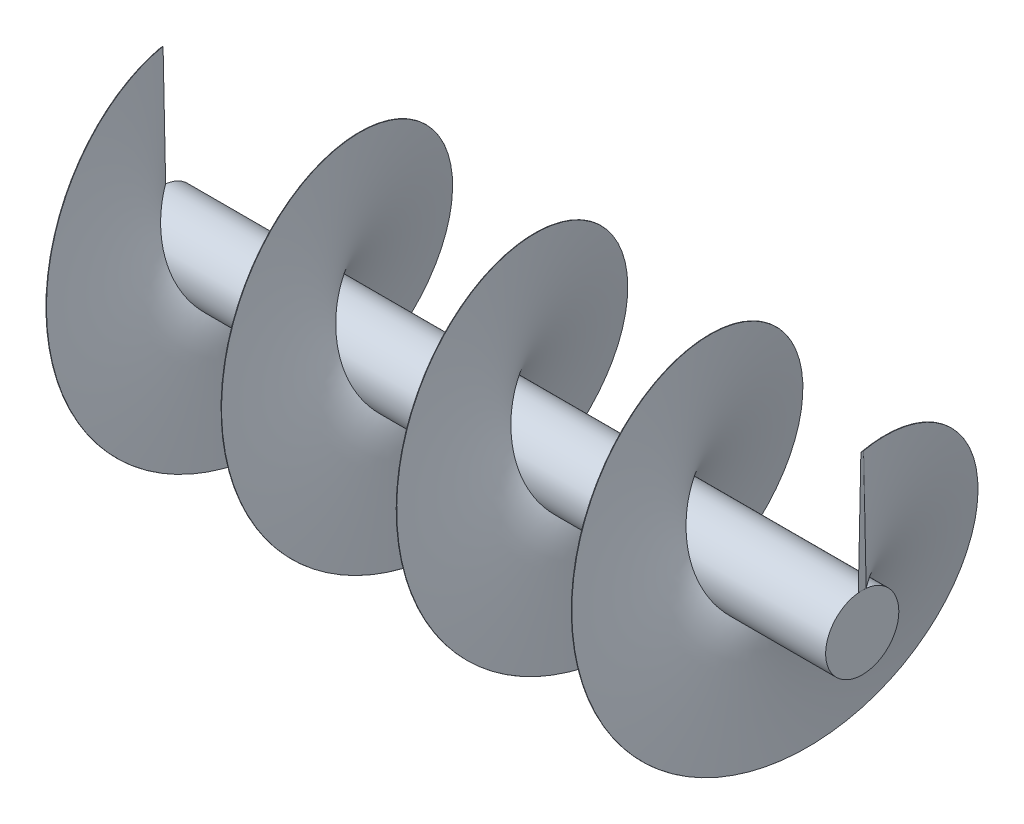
from build123d import *

# Parameters (mm, degrees)
SKETCH1_R           = 10
BOSS_EXTRUDE1_DEPTH = 390
BOSS_EXTRUDE2_START = 300
SKETCH1_3_R         = 10
BOSS_EXTRUDE2_DEPTH = 300
BOSS_EXTRUDE3_START = 300
SKETCH1_4_R         = 35
SKETCH1_4_R_2       = 25
BOSS_EXTRUDE3_DEPTH = 670
BOSS_EXTRUDE4_START = -360
SKETCH1_5_R         = 25
SKETCH1_5_R_2       = 10
BOSS_EXTRUDE4_DEPTH = 10
BOSS_EXTRUDE5_START = 300
SKETCH1_6_R         = 25
SKETCH1_6_R_2       = 10
BOSS_EXTRUDE5_DEPTH = 10
SWEEP1_PITCH        = 167.5
SWEEP1_HEIGHT       = 670
SWEEP1_RADIUS       = 150
SWEEP1_START_ANGLE  = -90


with BuildPart() as part:
    # Sketch1 → Boss-Extrude1 (new body)
    with BuildSketch(Plane(origin=(0, 0, 0), x_dir=(0, 0, -1), z_dir=(1, 0, 0))):
        Circle(SKETCH1_R)
    extrude(amount=-BOSS_EXTRUDE1_DEPTH)

    # Sketch1_3 → Boss-Extrude2 (add)
    with BuildSketch(Plane(origin=(0, 0, 0), x_dir=(0, 0, -1), z_dir=(1, 0, 0)).offset(BOSS_EXTRUDE2_START)):
        Circle(SKETCH1_3_R)
    extrude(amount=-BOSS_EXTRUDE2_DEPTH)



with BuildPart() as body_2:
    # Sketch1_4 → Boss-Extrude3 (new body)
    with BuildSketch(Plane(origin=(0, 0, 0), x_dir=(0, 0, -1), z_dir=(1, 0, 0)).offset(BOSS_EXTRUDE3_START)):
        Circle(SKETCH1_4_R)
        Circle(SKETCH1_4_R_2, mode=Mode.SUBTRACT)
    extrude(amount=-BOSS_EXTRUDE3_DEPTH)


with BuildPart() as part_1:
    add(part.part)

    add(body_2.part)  # Boss-Extrude4 merges body 2
    # Sketch1_5 → Boss-Extrude4 (add)
    with BuildSketch(Plane(origin=(0, 0, 0), x_dir=(0, 0, -1), z_dir=(1, 0, 0)).offset(BOSS_EXTRUDE4_START)):
        Circle(SKETCH1_5_R)
        Circle(SKETCH1_5_R_2, mode=Mode.SUBTRACT)
    extrude(amount=-BOSS_EXTRUDE4_DEPTH)

    # Sketch1_6 → Boss-Extrude5 (add)
    with BuildSketch(Plane(origin=(0, 0, 0), x_dir=(0, 0, -1), z_dir=(1, 0, 0)).offset(BOSS_EXTRUDE5_START)):
        Circle(SKETCH1_6_R)
        Circle(SKETCH1_6_R_2, mode=Mode.SUBTRACT)
    extrude(amount=-BOSS_EXTRUDE5_DEPTH)


with BuildPart() as body_2_2:
    # Sweep1: sweep along a helix
    with BuildLine() as sweep1_path:
        add(Helix(SWEEP1_PITCH, SWEEP1_HEIGHT, SWEEP1_RADIUS, center=(-370, 0, 0), direction=(1, 0, 0), mode=Mode.PRIVATE).rotate(Axis((-370, 0, 0), (1, 0, 0)), SWEEP1_START_ANGLE))
    # Sketch3 → Sweep1 (sweep)
    with BuildSketch(Plane.ZY.offset(370)):
        with BuildLine():
            Line((-1.308980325, 149.99428846), (-3.75, 34.798527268))
            ThreePointArc((-3.75, 34.798527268), (0, 35), (3.75, 34.798527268))
            Line((3.75, 34.798527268), (1.308980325, 149.99428846))
            ThreePointArc((1.308980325, 149.99428846), (0, 150), (-1.308980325, 149.99428846))
        make_face()
    sweep(path=sweep1_path.line, is_frenet=True)


solid = Compound([part_1.part, body_2_2.part])
